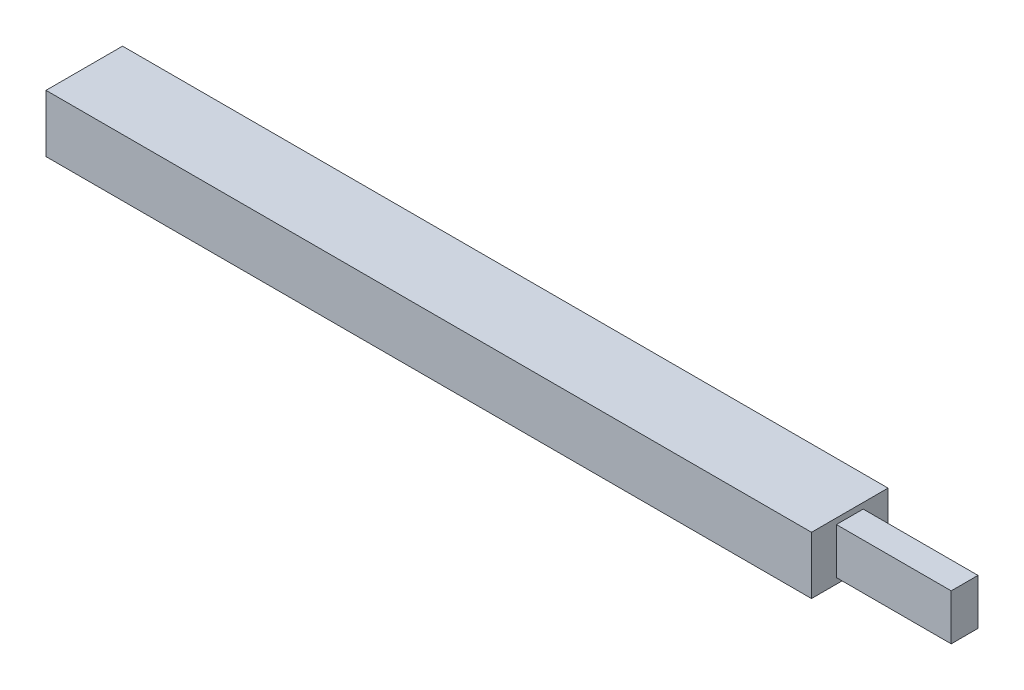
ISO-10303-21;
HEADER;
FILE_DESCRIPTION(('STEP AP214'),'2;1');
FILE_NAME('part.step','',(''),(''),'','','');
FILE_SCHEMA(('AUTOMOTIVE_DESIGN { 1 0 10303 214 1 1 1 1 }'));
ENDSEC;
DATA;
#1=APPLICATION_CONTEXT('core data for automotive mechanical design processes');
#2=APPLICATION_PROTOCOL_DEFINITION('international standard','automotive_design',2000,#1);
#3=PRODUCT_CONTEXT('',#1,'mechanical');
#4=PRODUCT('Part','Part','',(#3));
#5=PRODUCT_RELATED_PRODUCT_CATEGORY('part','',(#4));
#6=PRODUCT_DEFINITION_FORMATION('','',#4);
#7=PRODUCT_DEFINITION_CONTEXT('part definition',#1,'design');
#8=PRODUCT_DEFINITION('design','',#6,#7);
#9=PRODUCT_DEFINITION_SHAPE('','',#8);
#10=(LENGTH_UNIT() NAMED_UNIT(*) SI_UNIT(.MILLI.,.METRE.));
#11=(NAMED_UNIT(*) PLANE_ANGLE_UNIT() SI_UNIT($,.RADIAN.));
#12=(NAMED_UNIT(*) SI_UNIT($,.STERADIAN.) SOLID_ANGLE_UNIT());
#13=UNCERTAINTY_MEASURE_WITH_UNIT(LENGTH_MEASURE(1.E-05),#10,'distance_accuracy_value','');
#14=(GEOMETRIC_REPRESENTATION_CONTEXT(3) GLOBAL_UNCERTAINTY_ASSIGNED_CONTEXT((#13)) GLOBAL_UNIT_ASSIGNED_CONTEXT((#10,
#11,#12)) REPRESENTATION_CONTEXT('',''));
#15=CARTESIAN_POINT('',(0.,0.,0.));
#16=DIRECTION('',(0.,0.,1.));
#17=DIRECTION('',(1.,0.,0.));
#18=AXIS2_PLACEMENT_3D('',#15,#16,#17);
#19=CARTESIAN_POINT('',(100.,15.,-10.));
#20=DIRECTION('',(-1.,0.,0.));
#21=DIRECTION('',(0.,0.,1.));
#22=AXIS2_PLACEMENT_3D('',#19,#20,#21);
#23=PLANE('',#22);
#24=DIRECTION('',(0.,0.,-1.));
#25=VECTOR('',#24,1.);
#26=CARTESIAN_POINT('',(100.,0.,-10.));
#27=LINE('',#26,#25);
#28=CARTESIAN_POINT('',(100.,0.,9.99999999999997));
#29=VERTEX_POINT('',#28);
#30=CARTESIAN_POINT('',(100.,0.,-10.));
#31=VERTEX_POINT('',#30);
#32=EDGE_CURVE('E145',#29,#31,#27,.T.);
#33=ORIENTED_EDGE('',*,*,#32,.T.);
#34=DIRECTION('',(0.,-1.,0.));
#35=VECTOR('',#34,1.);
#36=CARTESIAN_POINT('',(100.,15.,-10.));
#37=LINE('',#36,#35);
#38=CARTESIAN_POINT('',(100.,15.,-10.));
#39=VERTEX_POINT('',#38);
#40=EDGE_CURVE('E150',#39,#31,#37,.T.);
#41=ORIENTED_EDGE('',*,*,#40,.F.);
#42=DIRECTION('',(0.,0.,-1.));
#43=VECTOR('',#42,1.);
#44=CARTESIAN_POINT('',(100.,15.,-10.));
#45=LINE('',#44,#43);
#46=CARTESIAN_POINT('',(100.,15.,9.99999999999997));
#47=VERTEX_POINT('',#46);
#48=EDGE_CURVE('E139',#47,#39,#45,.T.);
#49=ORIENTED_EDGE('',*,*,#48,.F.);
#50=DIRECTION('',(0.,-1.,0.));
#51=VECTOR('',#50,1.);
#52=CARTESIAN_POINT('',(100.,15.,9.99999999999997));
#53=LINE('',#52,#51);
#54=EDGE_CURVE('E47',#47,#29,#53,.T.);
#55=ORIENTED_EDGE('',*,*,#54,.T.);
#56=EDGE_LOOP('',(#33,#41,#49,#55));
#57=FACE_BOUND('',#56,.T.);
#58=DIRECTION('',(0.,0.,1.));
#59=VECTOR('',#58,1.);
#60=CARTESIAN_POINT('',(100.,13.5,-3.5));
#61=LINE('',#60,#59);
#62=CARTESIAN_POINT('',(100.,13.5,-3.5));
#63=VERTEX_POINT('',#62);
#64=CARTESIAN_POINT('',(100.,13.5,3.5));
#65=VERTEX_POINT('',#64);
#66=EDGE_CURVE('E54',#63,#65,#61,.T.);
#67=ORIENTED_EDGE('',*,*,#66,.F.);
#68=DIRECTION('',(0.,1.,0.));
#69=VECTOR('',#68,1.);
#70=CARTESIAN_POINT('',(100.,1.5,-3.5));
#71=LINE('',#70,#69);
#72=CARTESIAN_POINT('',(100.,1.5,-3.5));
#73=VERTEX_POINT('',#72);
#74=EDGE_CURVE('E58',#73,#63,#71,.T.);
#75=ORIENTED_EDGE('',*,*,#74,.F.);
#76=DIRECTION('',(0.,0.,-1.));
#77=VECTOR('',#76,1.);
#78=CARTESIAN_POINT('',(100.,1.5,3.5));
#79=LINE('',#78,#77);
#80=CARTESIAN_POINT('',(100.,1.5,3.5));
#81=VERTEX_POINT('',#80);
#82=EDGE_CURVE('E288',#81,#73,#79,.T.);
#83=ORIENTED_EDGE('',*,*,#82,.F.);
#84=DIRECTION('',(0.,-1.,0.));
#85=VECTOR('',#84,1.);
#86=CARTESIAN_POINT('',(100.,13.5,3.5));
#87=LINE('',#86,#85);
#88=EDGE_CURVE('E294',#65,#81,#87,.T.);
#89=ORIENTED_EDGE('',*,*,#88,.F.);
#90=EDGE_LOOP('',(#67,#75,#83,#89));
#91=FACE_BOUND('',#90,.T.);
#92=ADVANCED_FACE('F39',(#57,#91),#23,.F.);
#93=CARTESIAN_POINT('',(-100.,15.,9.99999999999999));
#94=DIRECTION('',(1.,0.,0.));
#95=DIRECTION('',(0.,0.,-1.));
#96=AXIS2_PLACEMENT_3D('',#93,#94,#95);
#97=PLANE('',#96);
#98=DIRECTION('',(0.,0.,1.));
#99=VECTOR('',#98,1.);
#100=CARTESIAN_POINT('',(-100.,0.,9.99999999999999));
#101=LINE('',#100,#99);
#102=CARTESIAN_POINT('',(-100.,0.,-10.));
#103=VERTEX_POINT('',#102);
#104=CARTESIAN_POINT('',(-100.,0.,9.99999999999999));
#105=VERTEX_POINT('',#104);
#106=EDGE_CURVE('E124',#103,#105,#101,.T.);
#107=ORIENTED_EDGE('',*,*,#106,.T.);
#108=DIRECTION('',(0.,-1.,0.));
#109=VECTOR('',#108,1.);
#110=CARTESIAN_POINT('',(-100.,15.,9.99999999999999));
#111=LINE('',#110,#109);
#112=CARTESIAN_POINT('',(-100.,15.,9.99999999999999));
#113=VERTEX_POINT('',#112);
#114=EDGE_CURVE('E11',#113,#105,#111,.T.);
#115=ORIENTED_EDGE('',*,*,#114,.F.);
#116=DIRECTION('',(0.,0.,1.));
#117=VECTOR('',#116,1.);
#118=CARTESIAN_POINT('',(-100.,15.,9.99999999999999));
#119=LINE('',#118,#117);
#120=CARTESIAN_POINT('',(-100.,15.,-10.));
#121=VERTEX_POINT('',#120);
#122=EDGE_CURVE('E133',#121,#113,#119,.T.);
#123=ORIENTED_EDGE('',*,*,#122,.F.);
#124=DIRECTION('',(0.,-1.,0.));
#125=VECTOR('',#124,1.);
#126=CARTESIAN_POINT('',(-100.,15.,-10.));
#127=LINE('',#126,#125);
#128=EDGE_CURVE('E142',#121,#103,#127,.T.);
#129=ORIENTED_EDGE('',*,*,#128,.T.);
#130=EDGE_LOOP('',(#107,#115,#123,#129));
#131=FACE_BOUND('',#130,.T.);
#132=ADVANCED_FACE('F41',(#131),#97,.F.);
#133=CARTESIAN_POINT('',(100.,15.,9.99999999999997));
#134=DIRECTION('',(0.,0.,-1.));
#135=DIRECTION('',(-1.,0.,0.));
#136=AXIS2_PLACEMENT_3D('',#133,#134,#135);
#137=PLANE('',#136);
#138=DIRECTION('',(1.,0.,0.));
#139=VECTOR('',#138,1.);
#140=CARTESIAN_POINT('',(100.,0.,9.99999999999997));
#141=LINE('',#140,#139);
#142=EDGE_CURVE('E127',#105,#29,#141,.T.);
#143=ORIENTED_EDGE('',*,*,#142,.T.);
#144=ORIENTED_EDGE('',*,*,#54,.F.);
#145=DIRECTION('',(1.,0.,0.));
#146=VECTOR('',#145,1.);
#147=CARTESIAN_POINT('',(100.,15.,9.99999999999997));
#148=LINE('',#147,#146);
#149=EDGE_CURVE('E136',#113,#47,#148,.T.);
#150=ORIENTED_EDGE('',*,*,#149,.F.);
#151=ORIENTED_EDGE('',*,*,#114,.T.);
#152=EDGE_LOOP('',(#143,#144,#150,#151));
#153=FACE_BOUND('',#152,.T.);
#154=ADVANCED_FACE('F172',(#153),#137,.F.);
#155=CARTESIAN_POINT('',(-100.,15.,-10.));
#156=DIRECTION('',(0.,0.,1.));
#157=DIRECTION('',(1.,0.,0.));
#158=AXIS2_PLACEMENT_3D('',#155,#156,#157);
#159=PLANE('',#158);
#160=DIRECTION('',(-1.,0.,0.));
#161=VECTOR('',#160,1.);
#162=CARTESIAN_POINT('',(-100.,0.,-10.));
#163=LINE('',#162,#161);
#164=EDGE_CURVE('E137',#31,#103,#163,.T.);
#165=ORIENTED_EDGE('',*,*,#164,.T.);
#166=ORIENTED_EDGE('',*,*,#128,.F.);
#167=DIRECTION('',(-1.,0.,0.));
#168=VECTOR('',#167,1.);
#169=CARTESIAN_POINT('',(-100.,15.,-10.));
#170=LINE('',#169,#168);
#171=EDGE_CURVE('E141',#39,#121,#170,.T.);
#172=ORIENTED_EDGE('',*,*,#171,.F.);
#173=ORIENTED_EDGE('',*,*,#40,.T.);
#174=EDGE_LOOP('',(#165,#166,#172,#173));
#175=FACE_BOUND('',#174,.T.);
#176=ADVANCED_FACE('F165',(#175),#159,.F.);
#177=CARTESIAN_POINT('',(0.,15.,0.));
#178=DIRECTION('',(0.,-1.,0.));
#179=DIRECTION('',(0.,0.,-1.));
#180=AXIS2_PLACEMENT_3D('',#177,#178,#179);
#181=PLANE('',#180);
#182=ORIENTED_EDGE('',*,*,#122,.T.);
#183=ORIENTED_EDGE('',*,*,#149,.T.);
#184=ORIENTED_EDGE('',*,*,#48,.T.);
#185=ORIENTED_EDGE('',*,*,#171,.T.);
#186=EDGE_LOOP('',(#182,#183,#184,#185));
#187=FACE_BOUND('',#186,.T.);
#188=ADVANCED_FACE('F171',(#187),#181,.F.);
#189=CARTESIAN_POINT('',(0.,0.,0.));
#190=DIRECTION('',(0.,-1.,0.));
#191=DIRECTION('',(0.,0.,-1.));
#192=AXIS2_PLACEMENT_3D('',#189,#190,#191);
#193=PLANE('',#192);
#194=ORIENTED_EDGE('',*,*,#106,.F.);
#195=ORIENTED_EDGE('',*,*,#164,.F.);
#196=ORIENTED_EDGE('',*,*,#32,.F.);
#197=ORIENTED_EDGE('',*,*,#142,.F.);
#198=EDGE_LOOP('',(#194,#195,#196,#197));
#199=FACE_BOUND('',#198,.T.);
#200=ADVANCED_FACE('F162',(#199),#193,.T.);
#201=CARTESIAN_POINT('',(130.,13.5,-3.5));
#202=DIRECTION('',(0.,-1.,0.));
#203=DIRECTION('',(0.,0.,-1.));
#204=AXIS2_PLACEMENT_3D('',#201,#202,#203);
#205=PLANE('',#204);
#206=ORIENTED_EDGE('',*,*,#66,.T.);
#207=DIRECTION('',(-1.,0.,0.));
#208=VECTOR('',#207,1.);
#209=CARTESIAN_POINT('',(130.,13.5,3.5));
#210=LINE('',#209,#208);
#211=CARTESIAN_POINT('',(130.,13.5,3.5));
#212=VERTEX_POINT('',#211);
#213=EDGE_CURVE('E107',#212,#65,#210,.T.);
#214=ORIENTED_EDGE('',*,*,#213,.F.);
#215=DIRECTION('',(0.,0.,1.));
#216=VECTOR('',#215,1.);
#217=CARTESIAN_POINT('',(130.,13.5,-3.5));
#218=LINE('',#217,#216);
#219=CARTESIAN_POINT('',(130.,13.5,-3.5));
#220=VERTEX_POINT('',#219);
#221=EDGE_CURVE('E113',#220,#212,#218,.T.);
#222=ORIENTED_EDGE('',*,*,#221,.F.);
#223=DIRECTION('',(-1.,0.,0.));
#224=VECTOR('',#223,1.);
#225=CARTESIAN_POINT('',(130.,13.5,-3.5));
#226=LINE('',#225,#224);
#227=EDGE_CURVE('E286',#220,#63,#226,.T.);
#228=ORIENTED_EDGE('',*,*,#227,.T.);
#229=EDGE_LOOP('',(#206,#214,#222,#228));
#230=FACE_BOUND('',#229,.T.);
#231=ADVANCED_FACE('F123',(#230),#205,.F.);
#232=CARTESIAN_POINT('',(130.,13.5,3.5));
#233=DIRECTION('',(0.,0.,-1.));
#234=DIRECTION('',(0.,1.,0.));
#235=AXIS2_PLACEMENT_3D('',#232,#233,#234);
#236=PLANE('',#235);
#237=ORIENTED_EDGE('',*,*,#88,.T.);
#238=DIRECTION('',(-1.,0.,0.));
#239=VECTOR('',#238,1.);
#240=CARTESIAN_POINT('',(130.,1.5,3.5));
#241=LINE('',#240,#239);
#242=CARTESIAN_POINT('',(130.,1.5,3.5));
#243=VERTEX_POINT('',#242);
#244=EDGE_CURVE('E109',#243,#81,#241,.T.);
#245=ORIENTED_EDGE('',*,*,#244,.F.);
#246=DIRECTION('',(0.,-1.,0.));
#247=VECTOR('',#246,1.);
#248=CARTESIAN_POINT('',(130.,13.5,3.5));
#249=LINE('',#248,#247);
#250=EDGE_CURVE('E102',#212,#243,#249,.T.);
#251=ORIENTED_EDGE('',*,*,#250,.F.);
#252=ORIENTED_EDGE('',*,*,#213,.T.);
#253=EDGE_LOOP('',(#237,#245,#251,#252));
#254=FACE_BOUND('',#253,.T.);
#255=ADVANCED_FACE('F105',(#254),#236,.F.);
#256=CARTESIAN_POINT('',(130.,1.5,3.5));
#257=DIRECTION('',(0.,1.,0.));
#258=DIRECTION('',(0.,0.,1.));
#259=AXIS2_PLACEMENT_3D('',#256,#257,#258);
#260=PLANE('',#259);
#261=ORIENTED_EDGE('',*,*,#82,.T.);
#262=DIRECTION('',(-1.,0.,0.));
#263=VECTOR('',#262,1.);
#264=CARTESIAN_POINT('',(130.,1.5,-3.5));
#265=LINE('',#264,#263);
#266=CARTESIAN_POINT('',(130.,1.5,-3.5));
#267=VERTEX_POINT('',#266);
#268=EDGE_CURVE('E129',#267,#73,#265,.T.);
#269=ORIENTED_EDGE('',*,*,#268,.F.);
#270=DIRECTION('',(0.,0.,-1.));
#271=VECTOR('',#270,1.);
#272=CARTESIAN_POINT('',(130.,1.5,3.5));
#273=LINE('',#272,#271);
#274=EDGE_CURVE('E112',#243,#267,#273,.T.);
#275=ORIENTED_EDGE('',*,*,#274,.F.);
#276=ORIENTED_EDGE('',*,*,#244,.T.);
#277=EDGE_LOOP('',(#261,#269,#275,#276));
#278=FACE_BOUND('',#277,.T.);
#279=ADVANCED_FACE('F194',(#278),#260,.F.);
#280=CARTESIAN_POINT('',(130.,1.5,-3.5));
#281=DIRECTION('',(0.,0.,1.));
#282=DIRECTION('',(0.,-1.,0.));
#283=AXIS2_PLACEMENT_3D('',#280,#281,#282);
#284=PLANE('',#283);
#285=ORIENTED_EDGE('',*,*,#74,.T.);
#286=ORIENTED_EDGE('',*,*,#227,.F.);
#287=DIRECTION('',(0.,1.,0.));
#288=VECTOR('',#287,1.);
#289=CARTESIAN_POINT('',(130.,1.5,-3.5));
#290=LINE('',#289,#288);
#291=EDGE_CURVE('E118',#267,#220,#290,.T.);
#292=ORIENTED_EDGE('',*,*,#291,.F.);
#293=ORIENTED_EDGE('',*,*,#268,.T.);
#294=EDGE_LOOP('',(#285,#286,#292,#293));
#295=FACE_BOUND('',#294,.T.);
#296=ADVANCED_FACE('F197',(#295),#284,.F.);
#297=CARTESIAN_POINT('',(130.,0.,0.));
#298=DIRECTION('',(1.,0.,0.));
#299=DIRECTION('',(0.,0.,-1.));
#300=AXIS2_PLACEMENT_3D('',#297,#298,#299);
#301=PLANE('',#300);
#302=ORIENTED_EDGE('',*,*,#221,.T.);
#303=ORIENTED_EDGE('',*,*,#250,.T.);
#304=ORIENTED_EDGE('',*,*,#274,.T.);
#305=ORIENTED_EDGE('',*,*,#291,.T.);
#306=EDGE_LOOP('',(#302,#303,#304,#305));
#307=FACE_BOUND('',#306,.T.);
#308=ADVANCED_FACE('F116',(#307),#301,.T.);
#309=CLOSED_SHELL('',(#92,#132,#154,#176,#188,#200,#231,#255,#279,#296,#308));
#310=MANIFOLD_SOLID_BREP('B2',#309);
#311=ADVANCED_BREP_SHAPE_REPRESENTATION('',(#18,#310),#14);
#312=SHAPE_DEFINITION_REPRESENTATION(#9,#311);
ENDSEC;
END-ISO-10303-21;
